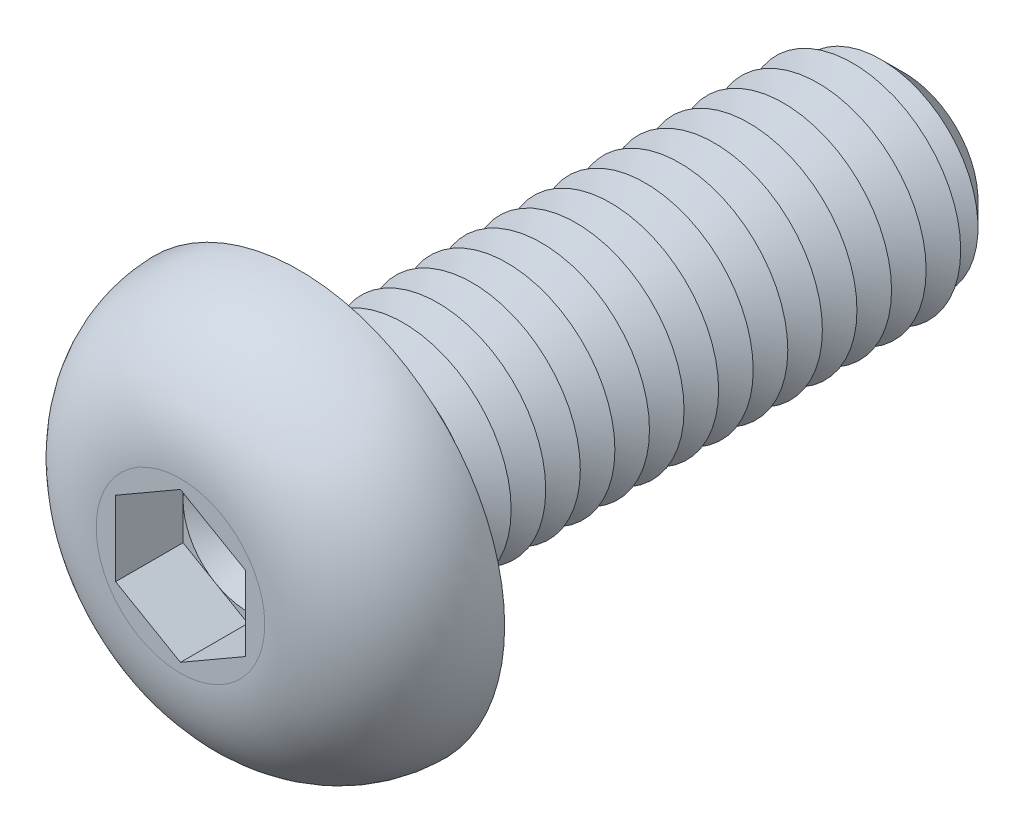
ISO-10303-21;
HEADER;
FILE_DESCRIPTION(('STEP AP214'),'2;1');
FILE_NAME('part.step','',(''),(''),'','','');
FILE_SCHEMA(('AUTOMOTIVE_DESIGN { 1 0 10303 214 1 1 1 1 }'));
ENDSEC;
DATA;
#1=APPLICATION_CONTEXT('core data for automotive mechanical design processes');
#2=APPLICATION_PROTOCOL_DEFINITION('international standard','automotive_design',2000,#1);
#3=PRODUCT_CONTEXT('',#1,'mechanical');
#4=PRODUCT('Part','Part','',(#3));
#5=PRODUCT_RELATED_PRODUCT_CATEGORY('part','',(#4));
#6=PRODUCT_DEFINITION_FORMATION('','',#4);
#7=PRODUCT_DEFINITION_CONTEXT('part definition',#1,'design');
#8=PRODUCT_DEFINITION('design','',#6,#7);
#9=PRODUCT_DEFINITION_SHAPE('','',#8);
#10=(LENGTH_UNIT() NAMED_UNIT(*) SI_UNIT(.MILLI.,.METRE.));
#11=(NAMED_UNIT(*) PLANE_ANGLE_UNIT() SI_UNIT($,.RADIAN.));
#12=(NAMED_UNIT(*) SI_UNIT($,.STERADIAN.) SOLID_ANGLE_UNIT());
#13=UNCERTAINTY_MEASURE_WITH_UNIT(LENGTH_MEASURE(1.E-05),#10,'distance_accuracy_value','');
#14=(GEOMETRIC_REPRESENTATION_CONTEXT(3) GLOBAL_UNCERTAINTY_ASSIGNED_CONTEXT((#13)) GLOBAL_UNIT_ASSIGNED_CONTEXT((#10,
#11,#12)) REPRESENTATION_CONTEXT('',''));
#15=CARTESIAN_POINT('',(0.,0.,0.));
#16=DIRECTION('',(0.,0.,1.));
#17=DIRECTION('',(1.,0.,0.));
#18=AXIS2_PLACEMENT_3D('',#15,#16,#17);
#19=CARTESIAN_POINT('',(0.,0.,1.19));
#20=DIRECTION('',(0.,0.,1.));
#21=DIRECTION('',(1.,0.,0.));
#22=AXIS2_PLACEMENT_3D('',#19,#20,#21);
#23=PLANE('',#22);
#24=CARTESIAN_POINT('',(0.,0.,1.19));
#25=DIRECTION('',(0.,0.,1.));
#26=DIRECTION('',(1.,0.,0.));
#27=AXIS2_PLACEMENT_3D('',#24,#25,#26);
#28=CIRCLE('',#27,1.5);
#29=CARTESIAN_POINT('',(1.5,0.,1.19));
#30=VERTEX_POINT('',#29);
#31=CARTESIAN_POINT('',(0.75,1.29903810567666,1.19));
#32=VERTEX_POINT('',#31);
#33=EDGE_CURVE('E117',#30,#32,#28,.T.);
#34=ORIENTED_EDGE('',*,*,#33,.F.);
#35=DIRECTION('',(0.,1.,0.));
#36=VECTOR('',#35,1.);
#37=CARTESIAN_POINT('',(1.5,-0.866025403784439,1.19));
#38=LINE('',#37,#36);
#39=CARTESIAN_POINT('',(1.5,0.86602540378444,1.19));
#40=VERTEX_POINT('',#39);
#41=EDGE_CURVE('E140',#30,#40,#38,.T.);
#42=ORIENTED_EDGE('',*,*,#41,.T.);
#43=DIRECTION('',(-0.866025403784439,0.5,0.));
#44=VECTOR('',#43,1.);
#45=CARTESIAN_POINT('',(1.5,0.86602540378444,1.19));
#46=LINE('',#45,#44);
#47=EDGE_CURVE('E135',#40,#32,#46,.T.);
#48=ORIENTED_EDGE('',*,*,#47,.T.);
#49=EDGE_LOOP('',(#34,#42,#48));
#50=FACE_BOUND('',#49,.T.);
#51=ADVANCED_FACE('F39',(#50),#23,.T.);
#52=CARTESIAN_POINT('',(0.,0.,1.19));
#53=DIRECTION('',(0.,0.,1.));
#54=DIRECTION('',(1.,0.,0.));
#55=AXIS2_PLACEMENT_3D('',#52,#53,#54);
#56=CIRCLE('',#55,1.5);
#57=CARTESIAN_POINT('',(-0.75,1.29903810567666,1.19));
#58=VERTEX_POINT('',#57);
#59=EDGE_CURVE('E11',#32,#58,#56,.T.);
#60=ORIENTED_EDGE('',*,*,#59,.F.);
#61=CARTESIAN_POINT('',(0.,1.73205080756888,1.19));
#62=VERTEX_POINT('',#61);
#63=EDGE_CURVE('E130',#32,#62,#46,.T.);
#64=ORIENTED_EDGE('',*,*,#63,.T.);
#65=DIRECTION('',(-0.866025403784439,-0.5,0.));
#66=VECTOR('',#65,1.);
#67=CARTESIAN_POINT('',(0.,1.73205080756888,1.19));
#68=LINE('',#67,#66);
#69=EDGE_CURVE('E132',#62,#58,#68,.T.);
#70=ORIENTED_EDGE('',*,*,#69,.T.);
#71=EDGE_LOOP('',(#60,#64,#70));
#72=FACE_BOUND('',#71,.T.);
#73=ADVANCED_FACE('F129',(#72),#23,.T.);
#74=CARTESIAN_POINT('',(-1.5,0.,1.19));
#75=VERTEX_POINT('',#74);
#76=EDGE_CURVE('E49',#58,#75,#56,.T.);
#77=ORIENTED_EDGE('',*,*,#76,.F.);
#78=CARTESIAN_POINT('',(-1.5,0.866025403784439,1.19));
#79=VERTEX_POINT('',#78);
#80=EDGE_CURVE('E143',#58,#79,#68,.T.);
#81=ORIENTED_EDGE('',*,*,#80,.T.);
#82=DIRECTION('',(0.,-1.,0.));
#83=VECTOR('',#82,1.);
#84=CARTESIAN_POINT('',(-1.5,0.866025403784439,1.19));
#85=LINE('',#84,#83);
#86=EDGE_CURVE('E154',#79,#75,#85,.T.);
#87=ORIENTED_EDGE('',*,*,#86,.T.);
#88=EDGE_LOOP('',(#77,#81,#87));
#89=FACE_BOUND('',#88,.T.);
#90=ADVANCED_FACE('F255',(#89),#23,.T.);
#91=CARTESIAN_POINT('',(-0.75,-1.29903810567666,1.19));
#92=VERTEX_POINT('',#91);
#93=EDGE_CURVE('E241',#75,#92,#56,.T.);
#94=ORIENTED_EDGE('',*,*,#93,.F.);
#95=CARTESIAN_POINT('',(-1.5,-0.866025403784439,1.19));
#96=VERTEX_POINT('',#95);
#97=EDGE_CURVE('E153',#75,#96,#85,.T.);
#98=ORIENTED_EDGE('',*,*,#97,.T.);
#99=DIRECTION('',(0.866025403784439,-0.5,0.));
#100=VECTOR('',#99,1.);
#101=CARTESIAN_POINT('',(-1.5,-0.866025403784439,1.19));
#102=LINE('',#101,#100);
#103=EDGE_CURVE('E159',#96,#92,#102,.T.);
#104=ORIENTED_EDGE('',*,*,#103,.T.);
#105=EDGE_LOOP('',(#94,#98,#104));
#106=FACE_BOUND('',#105,.T.);
#107=ADVANCED_FACE('F248',(#106),#23,.T.);
#108=CARTESIAN_POINT('',(0.75,-1.29903810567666,1.19));
#109=VERTEX_POINT('',#108);
#110=EDGE_CURVE('E56',#92,#109,#56,.T.);
#111=ORIENTED_EDGE('',*,*,#110,.F.);
#112=CARTESIAN_POINT('',(0.,-1.73205080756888,1.19));
#113=VERTEX_POINT('',#112);
#114=EDGE_CURVE('E158',#92,#113,#102,.T.);
#115=ORIENTED_EDGE('',*,*,#114,.T.);
#116=DIRECTION('',(0.866025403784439,0.5,0.));
#117=VECTOR('',#116,1.);
#118=CARTESIAN_POINT('',(0.,-1.73205080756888,1.19));
#119=LINE('',#118,#117);
#120=EDGE_CURVE('E164',#113,#109,#119,.T.);
#121=ORIENTED_EDGE('',*,*,#120,.T.);
#122=EDGE_LOOP('',(#111,#115,#121));
#123=FACE_BOUND('',#122,.T.);
#124=ADVANCED_FACE('F428',(#123),#23,.T.);
#125=CARTESIAN_POINT('',(0.,0.,-14.));
#126=DIRECTION('',(0.,0.,1.));
#127=DIRECTION('',(1.,0.,0.));
#128=AXIS2_PLACEMENT_3D('',#125,#126,#127);
#129=CYLINDRICAL_SURFACE('',#128,2.5);
#130=CARTESIAN_POINT('',(0.,0.,-0.399999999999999));
#131=DIRECTION('',(0.,0.,1.));
#132=DIRECTION('',(1.,0.,0.));
#133=AXIS2_PLACEMENT_3D('',#130,#131,#132);
#134=CIRCLE('',#133,2.5);
#135=CARTESIAN_POINT('',(2.5,0.,-0.399999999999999));
#136=VERTEX_POINT('',#135);
#137=EDGE_CURVE('E222',#136,#136,#134,.F.);
#138=ORIENTED_EDGE('',*,*,#137,.T.);
#139=EDGE_LOOP('',(#138));
#140=FACE_BOUND('',#139,.T.);
#141=CARTESIAN_POINT('',(0.,0.,-0.800000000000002));
#142=DIRECTION('',(0.,0.,1.));
#143=DIRECTION('',(1.,0.,0.));
#144=AXIS2_PLACEMENT_3D('',#141,#142,#143);
#145=CIRCLE('',#144,2.5);
#146=CARTESIAN_POINT('',(2.5,0.,-0.800000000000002));
#147=VERTEX_POINT('',#146);
#148=EDGE_CURVE('E149',#147,#147,#145,.T.);
#149=ORIENTED_EDGE('',*,*,#148,.T.);
#150=EDGE_LOOP('',(#149));
#151=FACE_BOUND('',#150,.T.);
#152=ADVANCED_FACE('F437',(#140,#151),#129,.T.);
#153=CARTESIAN_POINT('',(0.,4.75,0.));
#154=DIRECTION('',(0.,0.,1.));
#155=DIRECTION('',(1.,0.,0.));
#156=AXIS2_PLACEMENT_3D('',#153,#154,#155);
#157=PLANE('',#156);
#158=CARTESIAN_POINT('',(0.,0.,0.));
#159=DIRECTION('',(0.,0.,1.));
#160=DIRECTION('',(1.,0.,0.));
#161=AXIS2_PLACEMENT_3D('',#158,#159,#160);
#162=CIRCLE('',#161,2.9);
#163=CARTESIAN_POINT('',(2.9,0.,0.));
#164=VERTEX_POINT('',#163);
#165=EDGE_CURVE('E231',#164,#164,#162,.T.);
#166=ORIENTED_EDGE('',*,*,#165,.T.);
#167=EDGE_LOOP('',(#166));
#168=FACE_BOUND('',#167,.T.);
#169=CARTESIAN_POINT('',(0.,0.,0.));
#170=DIRECTION('',(0.,0.,1.));
#171=DIRECTION('',(1.,0.,0.));
#172=AXIS2_PLACEMENT_3D('',#169,#170,#171);
#173=CIRCLE('',#172,4.75);
#174=CARTESIAN_POINT('',(4.75,0.,0.));
#175=VERTEX_POINT('',#174);
#176=EDGE_CURVE('E196',#175,#175,#173,.T.);
#177=ORIENTED_EDGE('',*,*,#176,.F.);
#178=EDGE_LOOP('',(#177));
#179=FACE_BOUND('',#178,.T.);
#180=ADVANCED_FACE('F442',(#168,#179),#157,.F.);
#181=CARTESIAN_POINT('',(0.,0.,2.75));
#182=DIRECTION('',(0.,0.,-1.));
#183=DIRECTION('',(-1.,0.,0.));
#184=AXIS2_PLACEMENT_3D('',#181,#182,#183);
#185=PLANE('',#184);
#186=DIRECTION('',(-0.866025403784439,-0.5,0.));
#187=VECTOR('',#186,1.);
#188=CARTESIAN_POINT('',(0.,1.73205080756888,2.75));
#189=LINE('',#188,#187);
#190=CARTESIAN_POINT('',(0.,1.73205080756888,2.75));
#191=VERTEX_POINT('',#190);
#192=CARTESIAN_POINT('',(-1.5,0.866025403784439,2.75));
#193=VERTEX_POINT('',#192);
#194=EDGE_CURVE('E174',#191,#193,#189,.T.);
#195=ORIENTED_EDGE('',*,*,#194,.F.);
#196=DIRECTION('',(-0.866025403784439,0.5,0.));
#197=VECTOR('',#196,1.);
#198=CARTESIAN_POINT('',(1.5,0.86602540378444,2.75));
#199=LINE('',#198,#197);
#200=CARTESIAN_POINT('',(1.5,0.86602540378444,2.75));
#201=VERTEX_POINT('',#200);
#202=EDGE_CURVE('E64',#201,#191,#199,.T.);
#203=ORIENTED_EDGE('',*,*,#202,.F.);
#204=DIRECTION('',(0.,1.,0.));
#205=VECTOR('',#204,1.);
#206=CARTESIAN_POINT('',(1.5,-0.866025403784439,2.75));
#207=LINE('',#206,#205);
#208=CARTESIAN_POINT('',(1.5,-0.866025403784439,2.75));
#209=VERTEX_POINT('',#208);
#210=EDGE_CURVE('E138',#209,#201,#207,.T.);
#211=ORIENTED_EDGE('',*,*,#210,.F.);
#212=DIRECTION('',(0.866025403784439,0.5,0.));
#213=VECTOR('',#212,1.);
#214=CARTESIAN_POINT('',(0.,-1.73205080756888,2.75));
#215=LINE('',#214,#213);
#216=CARTESIAN_POINT('',(0.,-1.73205080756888,2.75));
#217=VERTEX_POINT('',#216);
#218=EDGE_CURVE('E186',#217,#209,#215,.T.);
#219=ORIENTED_EDGE('',*,*,#218,.F.);
#220=DIRECTION('',(0.866025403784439,-0.5,0.));
#221=VECTOR('',#220,1.);
#222=CARTESIAN_POINT('',(-1.5,-0.866025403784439,2.75));
#223=LINE('',#222,#221);
#224=CARTESIAN_POINT('',(-1.5,-0.866025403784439,2.75));
#225=VERTEX_POINT('',#224);
#226=EDGE_CURVE('E182',#225,#217,#223,.T.);
#227=ORIENTED_EDGE('',*,*,#226,.F.);
#228=DIRECTION('',(0.,-1.,0.));
#229=VECTOR('',#228,1.);
#230=CARTESIAN_POINT('',(-1.5,0.866025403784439,2.75));
#231=LINE('',#230,#229);
#232=EDGE_CURVE('E178',#193,#225,#231,.T.);
#233=ORIENTED_EDGE('',*,*,#232,.F.);
#234=EDGE_LOOP('',(#195,#203,#211,#219,#227,#233));
#235=FACE_BOUND('',#234,.T.);
#236=CARTESIAN_POINT('',(0.,0.,2.75));
#237=DIRECTION('',(0.,0.,1.));
#238=DIRECTION('',(1.,0.,0.));
#239=AXIS2_PLACEMENT_3D('',#236,#237,#238);
#240=CIRCLE('',#239,1.95044646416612);
#241=CARTESIAN_POINT('',(1.95044646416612,0.,2.75));
#242=VERTEX_POINT('',#241);
#243=EDGE_CURVE('E214',#242,#242,#240,.T.);
#244=ORIENTED_EDGE('',*,*,#243,.T.);
#245=EDGE_LOOP('',(#244));
#246=FACE_BOUND('',#245,.T.);
#247=ADVANCED_FACE('F264',(#235,#246),#185,.F.);
#248=CARTESIAN_POINT('',(0.,0.,-0.0500000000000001));
#249=DIRECTION('',(0.,0.,1.));
#250=DIRECTION('',(1.,0.,0.));
#251=AXIS2_PLACEMENT_3D('',#248,#249,#250);
#252=DEGENERATE_TOROIDAL_SURFACE('',#251,1.95044646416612,2.8,.T.);
#253=ORIENTED_EDGE('',*,*,#243,.F.);
#254=EDGE_LOOP('',(#253));
#255=FACE_BOUND('',#254,.T.);
#256=ORIENTED_EDGE('',*,*,#176,.T.);
#257=EDGE_LOOP('',(#256));
#258=FACE_BOUND('',#257,.T.);
#259=ADVANCED_FACE('F458',(#255,#258),#252,.T.);
#260=CARTESIAN_POINT('',(1.5,0.86602540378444,1.19));
#261=DIRECTION('',(0.5,0.866025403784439,0.));
#262=DIRECTION('',(-0.866025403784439,0.5,0.));
#263=AXIS2_PLACEMENT_3D('',#260,#261,#262);
#264=PLANE('',#263);
#265=ORIENTED_EDGE('',*,*,#202,.T.);
#266=DIRECTION('',(0.,0.,1.));
#267=VECTOR('',#266,1.);
#268=CARTESIAN_POINT('',(0.,1.73205080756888,1.19));
#269=LINE('',#268,#267);
#270=EDGE_CURVE('E136',#62,#191,#269,.T.);
#271=ORIENTED_EDGE('',*,*,#270,.F.);
#272=ORIENTED_EDGE('',*,*,#63,.F.);
#273=ORIENTED_EDGE('',*,*,#47,.F.);
#274=DIRECTION('',(0.,0.,1.));
#275=VECTOR('',#274,1.);
#276=CARTESIAN_POINT('',(1.5,0.86602540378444,1.19));
#277=LINE('',#276,#275);
#278=EDGE_CURVE('E193',#40,#201,#277,.T.);
#279=ORIENTED_EDGE('',*,*,#278,.T.);
#280=EDGE_LOOP('',(#265,#271,#272,#273,#279));
#281=FACE_BOUND('',#280,.T.);
#282=ADVANCED_FACE('F134',(#281),#264,.F.);
#283=CARTESIAN_POINT('',(1.5,-0.866025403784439,1.19));
#284=DIRECTION('',(1.,0.,0.));
#285=DIRECTION('',(0.,1.,0.));
#286=AXIS2_PLACEMENT_3D('',#283,#284,#285);
#287=PLANE('',#286);
#288=ORIENTED_EDGE('',*,*,#210,.T.);
#289=ORIENTED_EDGE('',*,*,#278,.F.);
#290=ORIENTED_EDGE('',*,*,#41,.F.);
#291=CARTESIAN_POINT('',(1.5,-0.866025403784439,1.19));
#292=VERTEX_POINT('',#291);
#293=EDGE_CURVE('E168',#292,#30,#38,.T.);
#294=ORIENTED_EDGE('',*,*,#293,.F.);
#295=DIRECTION('',(0.,0.,1.));
#296=VECTOR('',#295,1.);
#297=CARTESIAN_POINT('',(1.5,-0.866025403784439,1.19));
#298=LINE('',#297,#296);
#299=EDGE_CURVE('E197',#292,#209,#298,.T.);
#300=ORIENTED_EDGE('',*,*,#299,.T.);
#301=EDGE_LOOP('',(#288,#289,#290,#294,#300));
#302=FACE_BOUND('',#301,.T.);
#303=ADVANCED_FACE('F450',(#302),#287,.F.);
#304=CARTESIAN_POINT('',(0.,-1.73205080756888,1.19));
#305=DIRECTION('',(0.5,-0.866025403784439,0.));
#306=DIRECTION('',(0.866025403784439,0.5,0.));
#307=AXIS2_PLACEMENT_3D('',#304,#305,#306);
#308=PLANE('',#307);
#309=ORIENTED_EDGE('',*,*,#218,.T.);
#310=ORIENTED_EDGE('',*,*,#299,.F.);
#311=EDGE_CURVE('E163',#109,#292,#119,.T.);
#312=ORIENTED_EDGE('',*,*,#311,.F.);
#313=ORIENTED_EDGE('',*,*,#120,.F.);
#314=DIRECTION('',(0.,0.,1.));
#315=VECTOR('',#314,1.);
#316=CARTESIAN_POINT('',(0.,-1.73205080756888,1.19));
#317=LINE('',#316,#315);
#318=EDGE_CURVE('E200',#113,#217,#317,.T.);
#319=ORIENTED_EDGE('',*,*,#318,.T.);
#320=EDGE_LOOP('',(#309,#310,#312,#313,#319));
#321=FACE_BOUND('',#320,.T.);
#322=ADVANCED_FACE('F446',(#321),#308,.F.);
#323=CARTESIAN_POINT('',(-1.5,-0.866025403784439,1.19));
#324=DIRECTION('',(-0.5,-0.866025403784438,0.));
#325=DIRECTION('',(0.866025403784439,-0.5,0.));
#326=AXIS2_PLACEMENT_3D('',#323,#324,#325);
#327=PLANE('',#326);
#328=ORIENTED_EDGE('',*,*,#226,.T.);
#329=ORIENTED_EDGE('',*,*,#318,.F.);
#330=ORIENTED_EDGE('',*,*,#114,.F.);
#331=ORIENTED_EDGE('',*,*,#103,.F.);
#332=DIRECTION('',(0.,0.,1.));
#333=VECTOR('',#332,1.);
#334=CARTESIAN_POINT('',(-1.5,-0.866025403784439,1.19));
#335=LINE('',#334,#333);
#336=EDGE_CURVE('E203',#96,#225,#335,.T.);
#337=ORIENTED_EDGE('',*,*,#336,.T.);
#338=EDGE_LOOP('',(#328,#329,#330,#331,#337));
#339=FACE_BOUND('',#338,.T.);
#340=ADVANCED_FACE('F269',(#339),#327,.F.);
#341=CARTESIAN_POINT('',(-1.5,0.866025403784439,1.19));
#342=DIRECTION('',(-1.,0.,0.));
#343=DIRECTION('',(0.,-1.,0.));
#344=AXIS2_PLACEMENT_3D('',#341,#342,#343);
#345=PLANE('',#344);
#346=ORIENTED_EDGE('',*,*,#232,.T.);
#347=ORIENTED_EDGE('',*,*,#336,.F.);
#348=ORIENTED_EDGE('',*,*,#97,.F.);
#349=ORIENTED_EDGE('',*,*,#86,.F.);
#350=DIRECTION('',(0.,0.,1.));
#351=VECTOR('',#350,1.);
#352=CARTESIAN_POINT('',(-1.5,0.866025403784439,1.19));
#353=LINE('',#352,#351);
#354=EDGE_CURVE('E206',#79,#193,#353,.T.);
#355=ORIENTED_EDGE('',*,*,#354,.T.);
#356=EDGE_LOOP('',(#346,#347,#348,#349,#355));
#357=FACE_BOUND('',#356,.T.);
#358=ADVANCED_FACE('F253',(#357),#345,.F.);
#359=CARTESIAN_POINT('',(0.,1.73205080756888,1.19));
#360=DIRECTION('',(-0.5,0.866025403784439,0.));
#361=DIRECTION('',(-0.866025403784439,-0.5,0.));
#362=AXIS2_PLACEMENT_3D('',#359,#360,#361);
#363=PLANE('',#362);
#364=ORIENTED_EDGE('',*,*,#194,.T.);
#365=ORIENTED_EDGE('',*,*,#354,.F.);
#366=ORIENTED_EDGE('',*,*,#80,.F.);
#367=ORIENTED_EDGE('',*,*,#69,.F.);
#368=ORIENTED_EDGE('',*,*,#270,.T.);
#369=EDGE_LOOP('',(#364,#365,#366,#367,#368));
#370=FACE_BOUND('',#369,.T.);
#371=ADVANCED_FACE('F258',(#370),#363,.F.);
#372=EDGE_CURVE('E43',#109,#30,#56,.T.);
#373=ORIENTED_EDGE('',*,*,#372,.F.);
#374=ORIENTED_EDGE('',*,*,#311,.T.);
#375=ORIENTED_EDGE('',*,*,#293,.T.);
#376=EDGE_LOOP('',(#373,#374,#375));
#377=FACE_BOUND('',#376,.T.);
#378=ADVANCED_FACE('F419',(#377),#23,.T.);
#379=CARTESIAN_POINT('',(0.,0.,-0.800000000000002));
#380=DIRECTION('',(0.,0.,1.));
#381=DIRECTION('',(1.,0.,0.));
#382=AXIS2_PLACEMENT_3D('',#379,#380,#381);
#383=CONICAL_SURFACE('',#382,2.5,1.0471975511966);
#384=CARTESIAN_POINT('',(0.,0.,-1.2));
#385=DIRECTION('',(0.,0.,1.));
#386=DIRECTION('',(1.,0.,0.));
#387=AXIS2_PLACEMENT_3D('',#384,#385,#386);
#388=CIRCLE('',#387,1.80717967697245);
#389=CARTESIAN_POINT('',(1.80717967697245,0.,-1.2));
#390=VERTEX_POINT('',#389);
#391=EDGE_CURVE('E288',#390,#390,#388,.T.);
#392=ORIENTED_EDGE('',*,*,#391,.T.);
#393=EDGE_LOOP('',(#392));
#394=FACE_BOUND('',#393,.T.);
#395=ORIENTED_EDGE('',*,*,#148,.F.);
#396=EDGE_LOOP('',(#395));
#397=FACE_BOUND('',#396,.T.);
#398=ADVANCED_FACE('F426',(#394,#397),#383,.T.);
#399=CARTESIAN_POINT('',(0.,0.,-1.2));
#400=DIRECTION('',(0.,0.,-1.));
#401=DIRECTION('',(-1.,0.,0.));
#402=AXIS2_PLACEMENT_3D('',#399,#400,#401);
#403=CONICAL_SURFACE('',#402,1.80717967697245,1.04719755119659);
#404=CARTESIAN_POINT('',(0.,0.,-1.6));
#405=DIRECTION('',(0.,0.,1.));
#406=DIRECTION('',(1.,0.,0.));
#407=AXIS2_PLACEMENT_3D('',#404,#405,#406);
#408=CIRCLE('',#407,2.5);
#409=CARTESIAN_POINT('',(2.5,0.,-1.6));
#410=VERTEX_POINT('',#409);
#411=EDGE_CURVE('E293',#410,#410,#408,.T.);
#412=ORIENTED_EDGE('',*,*,#411,.T.);
#413=EDGE_LOOP('',(#412));
#414=FACE_BOUND('',#413,.T.);
#415=ORIENTED_EDGE('',*,*,#391,.F.);
#416=EDGE_LOOP('',(#415));
#417=FACE_BOUND('',#416,.T.);
#418=ADVANCED_FACE('F433',(#414,#417),#403,.T.);
#419=CARTESIAN_POINT('',(0.,0.,-1.6));
#420=DIRECTION('',(0.,0.,1.));
#421=DIRECTION('',(1.,0.,0.));
#422=AXIS2_PLACEMENT_3D('',#419,#420,#421);
#423=CONICAL_SURFACE('',#422,2.5,1.0471975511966);
#424=CARTESIAN_POINT('',(0.,0.,-2.));
#425=DIRECTION('',(0.,0.,1.));
#426=DIRECTION('',(1.,0.,0.));
#427=AXIS2_PLACEMENT_3D('',#424,#425,#426);
#428=CIRCLE('',#427,1.80717967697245);
#429=CARTESIAN_POINT('',(1.80717967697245,0.,-2.));
#430=VERTEX_POINT('',#429);
#431=EDGE_CURVE('E299',#430,#430,#428,.T.);
#432=ORIENTED_EDGE('',*,*,#431,.T.);
#433=EDGE_LOOP('',(#432));
#434=FACE_BOUND('',#433,.T.);
#435=ORIENTED_EDGE('',*,*,#411,.F.);
#436=EDGE_LOOP('',(#435));
#437=FACE_BOUND('',#436,.T.);
#438=ADVANCED_FACE('F868',(#434,#437),#423,.T.);
#439=CARTESIAN_POINT('',(0.,0.,-2.));
#440=DIRECTION('',(0.,0.,-1.));
#441=DIRECTION('',(-1.,0.,0.));
#442=AXIS2_PLACEMENT_3D('',#439,#440,#441);
#443=CONICAL_SURFACE('',#442,1.80717967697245,1.04719755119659);
#444=CARTESIAN_POINT('',(0.,0.,-2.4));
#445=DIRECTION('',(0.,0.,1.));
#446=DIRECTION('',(1.,0.,0.));
#447=AXIS2_PLACEMENT_3D('',#444,#445,#446);
#448=CIRCLE('',#447,2.5);
#449=CARTESIAN_POINT('',(2.5,0.,-2.4));
#450=VERTEX_POINT('',#449);
#451=EDGE_CURVE('E305',#450,#450,#448,.T.);
#452=ORIENTED_EDGE('',*,*,#451,.T.);
#453=EDGE_LOOP('',(#452));
#454=FACE_BOUND('',#453,.T.);
#455=ORIENTED_EDGE('',*,*,#431,.F.);
#456=EDGE_LOOP('',(#455));
#457=FACE_BOUND('',#456,.T.);
#458=ADVANCED_FACE('F858',(#454,#457),#443,.T.);
#459=CARTESIAN_POINT('',(0.,0.,-2.4));
#460=DIRECTION('',(0.,0.,1.));
#461=DIRECTION('',(1.,0.,0.));
#462=AXIS2_PLACEMENT_3D('',#459,#460,#461);
#463=CONICAL_SURFACE('',#462,2.5,1.0471975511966);
#464=CARTESIAN_POINT('',(0.,0.,-2.8));
#465=DIRECTION('',(0.,0.,1.));
#466=DIRECTION('',(1.,0.,0.));
#467=AXIS2_PLACEMENT_3D('',#464,#465,#466);
#468=CIRCLE('',#467,1.80717967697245);
#469=CARTESIAN_POINT('',(1.80717967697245,0.,-2.8));
#470=VERTEX_POINT('',#469);
#471=EDGE_CURVE('E309',#470,#470,#468,.T.);
#472=ORIENTED_EDGE('',*,*,#471,.T.);
#473=EDGE_LOOP('',(#472));
#474=FACE_BOUND('',#473,.T.);
#475=ORIENTED_EDGE('',*,*,#451,.F.);
#476=EDGE_LOOP('',(#475));
#477=FACE_BOUND('',#476,.T.);
#478=ADVANCED_FACE('F848',(#474,#477),#463,.T.);
#479=CARTESIAN_POINT('',(0.,0.,-2.8));
#480=DIRECTION('',(0.,0.,-1.));
#481=DIRECTION('',(-1.,0.,0.));
#482=AXIS2_PLACEMENT_3D('',#479,#480,#481);
#483=CONICAL_SURFACE('',#482,1.80717967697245,1.04719755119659);
#484=CARTESIAN_POINT('',(0.,0.,-3.2));
#485=DIRECTION('',(0.,0.,1.));
#486=DIRECTION('',(1.,0.,0.));
#487=AXIS2_PLACEMENT_3D('',#484,#485,#486);
#488=CIRCLE('',#487,2.5);
#489=CARTESIAN_POINT('',(2.5,0.,-3.2));
#490=VERTEX_POINT('',#489);
#491=EDGE_CURVE('E313',#490,#490,#488,.T.);
#492=ORIENTED_EDGE('',*,*,#491,.T.);
#493=EDGE_LOOP('',(#492));
#494=FACE_BOUND('',#493,.T.);
#495=ORIENTED_EDGE('',*,*,#471,.F.);
#496=EDGE_LOOP('',(#495));
#497=FACE_BOUND('',#496,.T.);
#498=ADVANCED_FACE('F838',(#494,#497),#483,.T.);
#499=CARTESIAN_POINT('',(0.,0.,-3.2));
#500=DIRECTION('',(0.,0.,1.));
#501=DIRECTION('',(1.,0.,0.));
#502=AXIS2_PLACEMENT_3D('',#499,#500,#501);
#503=CONICAL_SURFACE('',#502,2.5,1.0471975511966);
#504=CARTESIAN_POINT('',(0.,0.,-3.6));
#505=DIRECTION('',(0.,0.,1.));
#506=DIRECTION('',(1.,0.,0.));
#507=AXIS2_PLACEMENT_3D('',#504,#505,#506);
#508=CIRCLE('',#507,1.80717967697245);
#509=CARTESIAN_POINT('',(1.80717967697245,0.,-3.6));
#510=VERTEX_POINT('',#509);
#511=EDGE_CURVE('E317',#510,#510,#508,.T.);
#512=ORIENTED_EDGE('',*,*,#511,.T.);
#513=EDGE_LOOP('',(#512));
#514=FACE_BOUND('',#513,.T.);
#515=ORIENTED_EDGE('',*,*,#491,.F.);
#516=EDGE_LOOP('',(#515));
#517=FACE_BOUND('',#516,.T.);
#518=ADVANCED_FACE('F828',(#514,#517),#503,.T.);
#519=CARTESIAN_POINT('',(0.,0.,-3.6));
#520=DIRECTION('',(0.,0.,-1.));
#521=DIRECTION('',(-1.,0.,0.));
#522=AXIS2_PLACEMENT_3D('',#519,#520,#521);
#523=CONICAL_SURFACE('',#522,1.80717967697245,1.04719755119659);
#524=CARTESIAN_POINT('',(0.,0.,-4.));
#525=DIRECTION('',(0.,0.,1.));
#526=DIRECTION('',(1.,0.,0.));
#527=AXIS2_PLACEMENT_3D('',#524,#525,#526);
#528=CIRCLE('',#527,2.5);
#529=CARTESIAN_POINT('',(2.5,0.,-4.));
#530=VERTEX_POINT('',#529);
#531=EDGE_CURVE('E320',#530,#530,#528,.T.);
#532=ORIENTED_EDGE('',*,*,#531,.T.);
#533=EDGE_LOOP('',(#532));
#534=FACE_BOUND('',#533,.T.);
#535=ORIENTED_EDGE('',*,*,#511,.F.);
#536=EDGE_LOOP('',(#535));
#537=FACE_BOUND('',#536,.T.);
#538=ADVANCED_FACE('F818',(#534,#537),#523,.T.);
#539=CARTESIAN_POINT('',(0.,0.,-4.));
#540=DIRECTION('',(0.,0.,1.));
#541=DIRECTION('',(1.,0.,0.));
#542=AXIS2_PLACEMENT_3D('',#539,#540,#541);
#543=CONICAL_SURFACE('',#542,2.5,1.0471975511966);
#544=CARTESIAN_POINT('',(0.,0.,-4.4));
#545=DIRECTION('',(0.,0.,1.));
#546=DIRECTION('',(1.,0.,0.));
#547=AXIS2_PLACEMENT_3D('',#544,#545,#546);
#548=CIRCLE('',#547,1.80717967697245);
#549=CARTESIAN_POINT('',(1.80717967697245,0.,-4.4));
#550=VERTEX_POINT('',#549);
#551=EDGE_CURVE('E324',#550,#550,#548,.T.);
#552=ORIENTED_EDGE('',*,*,#551,.T.);
#553=EDGE_LOOP('',(#552));
#554=FACE_BOUND('',#553,.T.);
#555=ORIENTED_EDGE('',*,*,#531,.F.);
#556=EDGE_LOOP('',(#555));
#557=FACE_BOUND('',#556,.T.);
#558=ADVANCED_FACE('F808',(#554,#557),#543,.T.);
#559=CARTESIAN_POINT('',(0.,0.,-4.4));
#560=DIRECTION('',(0.,0.,-1.));
#561=DIRECTION('',(-1.,0.,0.));
#562=AXIS2_PLACEMENT_3D('',#559,#560,#561);
#563=CONICAL_SURFACE('',#562,1.80717967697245,1.04719755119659);
#564=CARTESIAN_POINT('',(0.,0.,-4.8));
#565=DIRECTION('',(0.,0.,1.));
#566=DIRECTION('',(1.,0.,0.));
#567=AXIS2_PLACEMENT_3D('',#564,#565,#566);
#568=CIRCLE('',#567,2.5);
#569=CARTESIAN_POINT('',(2.5,0.,-4.8));
#570=VERTEX_POINT('',#569);
#571=EDGE_CURVE('E328',#570,#570,#568,.T.);
#572=ORIENTED_EDGE('',*,*,#571,.T.);
#573=EDGE_LOOP('',(#572));
#574=FACE_BOUND('',#573,.T.);
#575=ORIENTED_EDGE('',*,*,#551,.F.);
#576=EDGE_LOOP('',(#575));
#577=FACE_BOUND('',#576,.T.);
#578=ADVANCED_FACE('F798',(#574,#577),#563,.T.);
#579=CARTESIAN_POINT('',(0.,0.,-4.8));
#580=DIRECTION('',(0.,0.,1.));
#581=DIRECTION('',(1.,0.,0.));
#582=AXIS2_PLACEMENT_3D('',#579,#580,#581);
#583=CONICAL_SURFACE('',#582,2.5,1.0471975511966);
#584=CARTESIAN_POINT('',(0.,0.,-5.2));
#585=DIRECTION('',(0.,0.,1.));
#586=DIRECTION('',(1.,0.,0.));
#587=AXIS2_PLACEMENT_3D('',#584,#585,#586);
#588=CIRCLE('',#587,1.80717967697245);
#589=CARTESIAN_POINT('',(1.80717967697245,0.,-5.2));
#590=VERTEX_POINT('',#589);
#591=EDGE_CURVE('E331',#590,#590,#588,.T.);
#592=ORIENTED_EDGE('',*,*,#591,.T.);
#593=EDGE_LOOP('',(#592));
#594=FACE_BOUND('',#593,.T.);
#595=ORIENTED_EDGE('',*,*,#571,.F.);
#596=EDGE_LOOP('',(#595));
#597=FACE_BOUND('',#596,.T.);
#598=ADVANCED_FACE('F788',(#594,#597),#583,.T.);
#599=CARTESIAN_POINT('',(0.,0.,-5.2));
#600=DIRECTION('',(0.,0.,-1.));
#601=DIRECTION('',(-1.,0.,0.));
#602=AXIS2_PLACEMENT_3D('',#599,#600,#601);
#603=CONICAL_SURFACE('',#602,1.80717967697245,1.04719755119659);
#604=CARTESIAN_POINT('',(0.,0.,-5.6));
#605=DIRECTION('',(0.,0.,1.));
#606=DIRECTION('',(1.,0.,0.));
#607=AXIS2_PLACEMENT_3D('',#604,#605,#606);
#608=CIRCLE('',#607,2.5);
#609=CARTESIAN_POINT('',(2.5,0.,-5.6));
#610=VERTEX_POINT('',#609);
#611=EDGE_CURVE('E335',#610,#610,#608,.T.);
#612=ORIENTED_EDGE('',*,*,#611,.T.);
#613=EDGE_LOOP('',(#612));
#614=FACE_BOUND('',#613,.T.);
#615=ORIENTED_EDGE('',*,*,#591,.F.);
#616=EDGE_LOOP('',(#615));
#617=FACE_BOUND('',#616,.T.);
#618=ADVANCED_FACE('F778',(#614,#617),#603,.T.);
#619=CARTESIAN_POINT('',(0.,0.,-5.6));
#620=DIRECTION('',(0.,0.,1.));
#621=DIRECTION('',(1.,0.,0.));
#622=AXIS2_PLACEMENT_3D('',#619,#620,#621);
#623=CONICAL_SURFACE('',#622,2.5,1.0471975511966);
#624=CARTESIAN_POINT('',(0.,0.,-6.));
#625=DIRECTION('',(0.,0.,1.));
#626=DIRECTION('',(1.,0.,0.));
#627=AXIS2_PLACEMENT_3D('',#624,#625,#626);
#628=CIRCLE('',#627,1.80717967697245);
#629=CARTESIAN_POINT('',(1.80717967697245,0.,-6.));
#630=VERTEX_POINT('',#629);
#631=EDGE_CURVE('E339',#630,#630,#628,.T.);
#632=ORIENTED_EDGE('',*,*,#631,.T.);
#633=EDGE_LOOP('',(#632));
#634=FACE_BOUND('',#633,.T.);
#635=ORIENTED_EDGE('',*,*,#611,.F.);
#636=EDGE_LOOP('',(#635));
#637=FACE_BOUND('',#636,.T.);
#638=ADVANCED_FACE('F768',(#634,#637),#623,.T.);
#639=CARTESIAN_POINT('',(0.,0.,-6.));
#640=DIRECTION('',(0.,0.,-1.));
#641=DIRECTION('',(-1.,0.,0.));
#642=AXIS2_PLACEMENT_3D('',#639,#640,#641);
#643=CONICAL_SURFACE('',#642,1.80717967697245,1.04719755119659);
#644=CARTESIAN_POINT('',(0.,0.,-6.4));
#645=DIRECTION('',(0.,0.,1.));
#646=DIRECTION('',(1.,0.,0.));
#647=AXIS2_PLACEMENT_3D('',#644,#645,#646);
#648=CIRCLE('',#647,2.5);
#649=CARTESIAN_POINT('',(2.5,0.,-6.4));
#650=VERTEX_POINT('',#649);
#651=EDGE_CURVE('E342',#650,#650,#648,.T.);
#652=ORIENTED_EDGE('',*,*,#651,.T.);
#653=EDGE_LOOP('',(#652));
#654=FACE_BOUND('',#653,.T.);
#655=ORIENTED_EDGE('',*,*,#631,.F.);
#656=EDGE_LOOP('',(#655));
#657=FACE_BOUND('',#656,.T.);
#658=ADVANCED_FACE('F758',(#654,#657),#643,.T.);
#659=CARTESIAN_POINT('',(0.,0.,-6.4));
#660=DIRECTION('',(0.,0.,1.));
#661=DIRECTION('',(1.,0.,0.));
#662=AXIS2_PLACEMENT_3D('',#659,#660,#661);
#663=CONICAL_SURFACE('',#662,2.5,1.0471975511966);
#664=CARTESIAN_POINT('',(0.,0.,-6.8));
#665=DIRECTION('',(0.,0.,1.));
#666=DIRECTION('',(1.,0.,0.));
#667=AXIS2_PLACEMENT_3D('',#664,#665,#666);
#668=CIRCLE('',#667,1.80717967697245);
#669=CARTESIAN_POINT('',(1.80717967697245,0.,-6.8));
#670=VERTEX_POINT('',#669);
#671=EDGE_CURVE('E346',#670,#670,#668,.T.);
#672=ORIENTED_EDGE('',*,*,#671,.T.);
#673=EDGE_LOOP('',(#672));
#674=FACE_BOUND('',#673,.T.);
#675=ORIENTED_EDGE('',*,*,#651,.F.);
#676=EDGE_LOOP('',(#675));
#677=FACE_BOUND('',#676,.T.);
#678=ADVANCED_FACE('F748',(#674,#677),#663,.T.);
#679=CARTESIAN_POINT('',(0.,0.,-6.8));
#680=DIRECTION('',(0.,0.,-1.));
#681=DIRECTION('',(-1.,0.,0.));
#682=AXIS2_PLACEMENT_3D('',#679,#680,#681);
#683=CONICAL_SURFACE('',#682,1.80717967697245,1.04719755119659);
#684=CARTESIAN_POINT('',(0.,0.,-7.2));
#685=DIRECTION('',(0.,0.,1.));
#686=DIRECTION('',(1.,0.,0.));
#687=AXIS2_PLACEMENT_3D('',#684,#685,#686);
#688=CIRCLE('',#687,2.5);
#689=CARTESIAN_POINT('',(2.5,0.,-7.2));
#690=VERTEX_POINT('',#689);
#691=EDGE_CURVE('E349',#690,#690,#688,.T.);
#692=ORIENTED_EDGE('',*,*,#691,.T.);
#693=EDGE_LOOP('',(#692));
#694=FACE_BOUND('',#693,.T.);
#695=ORIENTED_EDGE('',*,*,#671,.F.);
#696=EDGE_LOOP('',(#695));
#697=FACE_BOUND('',#696,.T.);
#698=ADVANCED_FACE('F738',(#694,#697),#683,.T.);
#699=CARTESIAN_POINT('',(0.,0.,-7.2));
#700=DIRECTION('',(0.,0.,1.));
#701=DIRECTION('',(1.,0.,0.));
#702=AXIS2_PLACEMENT_3D('',#699,#700,#701);
#703=CONICAL_SURFACE('',#702,2.5,1.0471975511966);
#704=CARTESIAN_POINT('',(0.,0.,-7.6));
#705=DIRECTION('',(0.,0.,1.));
#706=DIRECTION('',(1.,0.,0.));
#707=AXIS2_PLACEMENT_3D('',#704,#705,#706);
#708=CIRCLE('',#707,1.80717967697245);
#709=CARTESIAN_POINT('',(1.80717967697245,0.,-7.6));
#710=VERTEX_POINT('',#709);
#711=EDGE_CURVE('E353',#710,#710,#708,.T.);
#712=ORIENTED_EDGE('',*,*,#711,.T.);
#713=EDGE_LOOP('',(#712));
#714=FACE_BOUND('',#713,.T.);
#715=ORIENTED_EDGE('',*,*,#691,.F.);
#716=EDGE_LOOP('',(#715));
#717=FACE_BOUND('',#716,.T.);
#718=ADVANCED_FACE('F728',(#714,#717),#703,.T.);
#719=CARTESIAN_POINT('',(0.,0.,-7.6));
#720=DIRECTION('',(0.,0.,-1.));
#721=DIRECTION('',(-1.,0.,0.));
#722=AXIS2_PLACEMENT_3D('',#719,#720,#721);
#723=CONICAL_SURFACE('',#722,1.80717967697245,1.04719755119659);
#724=CARTESIAN_POINT('',(0.,0.,-8.));
#725=DIRECTION('',(0.,0.,1.));
#726=DIRECTION('',(1.,0.,0.));
#727=AXIS2_PLACEMENT_3D('',#724,#725,#726);
#728=CIRCLE('',#727,2.5);
#729=CARTESIAN_POINT('',(2.5,0.,-8.));
#730=VERTEX_POINT('',#729);
#731=EDGE_CURVE('E357',#730,#730,#728,.T.);
#732=ORIENTED_EDGE('',*,*,#731,.T.);
#733=EDGE_LOOP('',(#732));
#734=FACE_BOUND('',#733,.T.);
#735=ORIENTED_EDGE('',*,*,#711,.F.);
#736=EDGE_LOOP('',(#735));
#737=FACE_BOUND('',#736,.T.);
#738=ADVANCED_FACE('F718',(#734,#737),#723,.T.);
#739=CARTESIAN_POINT('',(0.,0.,-8.));
#740=DIRECTION('',(0.,0.,1.));
#741=DIRECTION('',(1.,0.,0.));
#742=AXIS2_PLACEMENT_3D('',#739,#740,#741);
#743=CONICAL_SURFACE('',#742,2.5,1.0471975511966);
#744=CARTESIAN_POINT('',(0.,0.,-8.4));
#745=DIRECTION('',(0.,0.,1.));
#746=DIRECTION('',(1.,0.,0.));
#747=AXIS2_PLACEMENT_3D('',#744,#745,#746);
#748=CIRCLE('',#747,1.80717967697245);
#749=CARTESIAN_POINT('',(1.80717967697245,0.,-8.4));
#750=VERTEX_POINT('',#749);
#751=EDGE_CURVE('E361',#750,#750,#748,.T.);
#752=ORIENTED_EDGE('',*,*,#751,.T.);
#753=EDGE_LOOP('',(#752));
#754=FACE_BOUND('',#753,.T.);
#755=ORIENTED_EDGE('',*,*,#731,.F.);
#756=EDGE_LOOP('',(#755));
#757=FACE_BOUND('',#756,.T.);
#758=ADVANCED_FACE('F708',(#754,#757),#743,.T.);
#759=CARTESIAN_POINT('',(0.,0.,-8.4));
#760=DIRECTION('',(0.,0.,-1.));
#761=DIRECTION('',(-1.,0.,0.));
#762=AXIS2_PLACEMENT_3D('',#759,#760,#761);
#763=CONICAL_SURFACE('',#762,1.80717967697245,1.04719755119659);
#764=CARTESIAN_POINT('',(0.,0.,-8.8));
#765=DIRECTION('',(0.,0.,1.));
#766=DIRECTION('',(1.,0.,0.));
#767=AXIS2_PLACEMENT_3D('',#764,#765,#766);
#768=CIRCLE('',#767,2.5);
#769=CARTESIAN_POINT('',(2.5,0.,-8.8));
#770=VERTEX_POINT('',#769);
#771=EDGE_CURVE('E365',#770,#770,#768,.T.);
#772=ORIENTED_EDGE('',*,*,#771,.T.);
#773=EDGE_LOOP('',(#772));
#774=FACE_BOUND('',#773,.T.);
#775=ORIENTED_EDGE('',*,*,#751,.F.);
#776=EDGE_LOOP('',(#775));
#777=FACE_BOUND('',#776,.T.);
#778=ADVANCED_FACE('F698',(#774,#777),#763,.T.);
#779=CARTESIAN_POINT('',(0.,0.,-8.8));
#780=DIRECTION('',(0.,0.,1.));
#781=DIRECTION('',(1.,0.,0.));
#782=AXIS2_PLACEMENT_3D('',#779,#780,#781);
#783=CONICAL_SURFACE('',#782,2.5,1.0471975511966);
#784=CARTESIAN_POINT('',(0.,0.,-9.2));
#785=DIRECTION('',(0.,0.,1.));
#786=DIRECTION('',(1.,0.,0.));
#787=AXIS2_PLACEMENT_3D('',#784,#785,#786);
#788=CIRCLE('',#787,1.80717967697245);
#789=CARTESIAN_POINT('',(1.80717967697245,0.,-9.2));
#790=VERTEX_POINT('',#789);
#791=EDGE_CURVE('E369',#790,#790,#788,.T.);
#792=ORIENTED_EDGE('',*,*,#791,.T.);
#793=EDGE_LOOP('',(#792));
#794=FACE_BOUND('',#793,.T.);
#795=ORIENTED_EDGE('',*,*,#771,.F.);
#796=EDGE_LOOP('',(#795));
#797=FACE_BOUND('',#796,.T.);
#798=ADVANCED_FACE('F688',(#794,#797),#783,.T.);
#799=CARTESIAN_POINT('',(0.,0.,-9.2));
#800=DIRECTION('',(0.,0.,-1.));
#801=DIRECTION('',(-1.,0.,0.));
#802=AXIS2_PLACEMENT_3D('',#799,#800,#801);
#803=CONICAL_SURFACE('',#802,1.80717967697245,1.04719755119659);
#804=CARTESIAN_POINT('',(0.,0.,-9.6));
#805=DIRECTION('',(0.,0.,1.));
#806=DIRECTION('',(1.,0.,0.));
#807=AXIS2_PLACEMENT_3D('',#804,#805,#806);
#808=CIRCLE('',#807,2.5);
#809=CARTESIAN_POINT('',(2.5,0.,-9.6));
#810=VERTEX_POINT('',#809);
#811=EDGE_CURVE('E284',#810,#810,#808,.T.);
#812=ORIENTED_EDGE('',*,*,#811,.T.);
#813=EDGE_LOOP('',(#812));
#814=FACE_BOUND('',#813,.T.);
#815=ORIENTED_EDGE('',*,*,#791,.F.);
#816=EDGE_LOOP('',(#815));
#817=FACE_BOUND('',#816,.T.);
#818=ADVANCED_FACE('F678',(#814,#817),#803,.T.);
#819=CARTESIAN_POINT('',(0.,0.,-9.6));
#820=DIRECTION('',(0.,0.,1.));
#821=DIRECTION('',(1.,0.,0.));
#822=AXIS2_PLACEMENT_3D('',#819,#820,#821);
#823=CONICAL_SURFACE('',#822,2.5,1.0471975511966);
#824=CARTESIAN_POINT('',(0.,0.,-10.));
#825=DIRECTION('',(0.,0.,1.));
#826=DIRECTION('',(1.,0.,0.));
#827=AXIS2_PLACEMENT_3D('',#824,#825,#826);
#828=CIRCLE('',#827,1.80717967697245);
#829=CARTESIAN_POINT('',(1.80717967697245,0.,-10.));
#830=VERTEX_POINT('',#829);
#831=EDGE_CURVE('E282',#830,#830,#828,.T.);
#832=ORIENTED_EDGE('',*,*,#831,.T.);
#833=EDGE_LOOP('',(#832));
#834=FACE_BOUND('',#833,.T.);
#835=ORIENTED_EDGE('',*,*,#811,.F.);
#836=EDGE_LOOP('',(#835));
#837=FACE_BOUND('',#836,.T.);
#838=ADVANCED_FACE('F668',(#834,#837),#823,.T.);
#839=CARTESIAN_POINT('',(0.,0.,-10.));
#840=DIRECTION('',(0.,0.,-1.));
#841=DIRECTION('',(-1.,0.,0.));
#842=AXIS2_PLACEMENT_3D('',#839,#840,#841);
#843=CONICAL_SURFACE('',#842,1.80717967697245,1.04719755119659);
#844=CARTESIAN_POINT('',(0.,0.,-10.4));
#845=DIRECTION('',(0.,0.,1.));
#846=DIRECTION('',(1.,0.,0.));
#847=AXIS2_PLACEMENT_3D('',#844,#845,#846);
#848=CIRCLE('',#847,2.5);
#849=CARTESIAN_POINT('',(2.5,0.,-10.4));
#850=VERTEX_POINT('',#849);
#851=EDGE_CURVE('E279',#850,#850,#848,.T.);
#852=ORIENTED_EDGE('',*,*,#851,.T.);
#853=EDGE_LOOP('',(#852));
#854=FACE_BOUND('',#853,.T.);
#855=ORIENTED_EDGE('',*,*,#831,.F.);
#856=EDGE_LOOP('',(#855));
#857=FACE_BOUND('',#856,.T.);
#858=ADVANCED_FACE('F658',(#854,#857),#843,.T.);
#859=CARTESIAN_POINT('',(0.,0.,-10.4));
#860=DIRECTION('',(0.,0.,1.));
#861=DIRECTION('',(1.,0.,0.));
#862=AXIS2_PLACEMENT_3D('',#859,#860,#861);
#863=CONICAL_SURFACE('',#862,2.5,1.0471975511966);
#864=CARTESIAN_POINT('',(0.,0.,-10.8));
#865=DIRECTION('',(0.,0.,1.));
#866=DIRECTION('',(1.,0.,0.));
#867=AXIS2_PLACEMENT_3D('',#864,#865,#866);
#868=CIRCLE('',#867,1.80717967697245);
#869=CARTESIAN_POINT('',(1.80717967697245,0.,-10.8));
#870=VERTEX_POINT('',#869);
#871=EDGE_CURVE('E276',#870,#870,#868,.T.);
#872=ORIENTED_EDGE('',*,*,#871,.T.);
#873=EDGE_LOOP('',(#872));
#874=FACE_BOUND('',#873,.T.);
#875=ORIENTED_EDGE('',*,*,#851,.F.);
#876=EDGE_LOOP('',(#875));
#877=FACE_BOUND('',#876,.T.);
#878=ADVANCED_FACE('F648',(#874,#877),#863,.T.);
#879=CARTESIAN_POINT('',(0.,0.,-10.8));
#880=DIRECTION('',(0.,0.,-1.));
#881=DIRECTION('',(-1.,0.,0.));
#882=AXIS2_PLACEMENT_3D('',#879,#880,#881);
#883=CONICAL_SURFACE('',#882,1.80717967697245,1.04719755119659);
#884=CARTESIAN_POINT('',(0.,0.,-11.2));
#885=DIRECTION('',(0.,0.,1.));
#886=DIRECTION('',(1.,0.,0.));
#887=AXIS2_PLACEMENT_3D('',#884,#885,#886);
#888=CIRCLE('',#887,2.5);
#889=CARTESIAN_POINT('',(2.5,0.,-11.2));
#890=VERTEX_POINT('',#889);
#891=EDGE_CURVE('E280',#890,#890,#888,.T.);
#892=ORIENTED_EDGE('',*,*,#891,.T.);
#893=EDGE_LOOP('',(#892));
#894=FACE_BOUND('',#893,.T.);
#895=ORIENTED_EDGE('',*,*,#871,.F.);
#896=EDGE_LOOP('',(#895));
#897=FACE_BOUND('',#896,.T.);
#898=ADVANCED_FACE('F638',(#894,#897),#883,.T.);
#899=CARTESIAN_POINT('',(0.,0.,-11.2));
#900=DIRECTION('',(0.,0.,1.));
#901=DIRECTION('',(1.,0.,0.));
#902=AXIS2_PLACEMENT_3D('',#899,#900,#901);
#903=CONICAL_SURFACE('',#902,2.5,1.0471975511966);
#904=CARTESIAN_POINT('',(0.,0.,-11.6));
#905=DIRECTION('',(0.,0.,1.));
#906=DIRECTION('',(1.,0.,0.));
#907=AXIS2_PLACEMENT_3D('',#904,#905,#906);
#908=CIRCLE('',#907,1.80717967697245);
#909=CARTESIAN_POINT('',(1.80717967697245,0.,-11.6));
#910=VERTEX_POINT('',#909);
#911=EDGE_CURVE('E382',#910,#910,#908,.T.);
#912=ORIENTED_EDGE('',*,*,#911,.T.);
#913=EDGE_LOOP('',(#912));
#914=FACE_BOUND('',#913,.T.);
#915=ORIENTED_EDGE('',*,*,#891,.F.);
#916=EDGE_LOOP('',(#915));
#917=FACE_BOUND('',#916,.T.);
#918=ADVANCED_FACE('F628',(#914,#917),#903,.T.);
#919=CARTESIAN_POINT('',(0.,0.,-11.6));
#920=DIRECTION('',(0.,0.,-1.));
#921=DIRECTION('',(-1.,0.,0.));
#922=AXIS2_PLACEMENT_3D('',#919,#920,#921);
#923=CONICAL_SURFACE('',#922,1.80717967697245,1.04719755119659);
#924=CARTESIAN_POINT('',(0.,0.,-12.));
#925=DIRECTION('',(0.,0.,1.));
#926=DIRECTION('',(1.,0.,0.));
#927=AXIS2_PLACEMENT_3D('',#924,#925,#926);
#928=CIRCLE('',#927,2.5);
#929=CARTESIAN_POINT('',(2.5,0.,-12.));
#930=VERTEX_POINT('',#929);
#931=EDGE_CURVE('E386',#930,#930,#928,.T.);
#932=ORIENTED_EDGE('',*,*,#931,.T.);
#933=EDGE_LOOP('',(#932));
#934=FACE_BOUND('',#933,.T.);
#935=ORIENTED_EDGE('',*,*,#911,.F.);
#936=EDGE_LOOP('',(#935));
#937=FACE_BOUND('',#936,.T.);
#938=ADVANCED_FACE('F618',(#934,#937),#923,.T.);
#939=CARTESIAN_POINT('',(0.,0.,-12.));
#940=DIRECTION('',(0.,0.,1.));
#941=DIRECTION('',(1.,0.,0.));
#942=AXIS2_PLACEMENT_3D('',#939,#940,#941);
#943=CONICAL_SURFACE('',#942,2.5,1.0471975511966);
#944=CARTESIAN_POINT('',(0.,0.,-12.4));
#945=DIRECTION('',(0.,0.,1.));
#946=DIRECTION('',(1.,0.,0.));
#947=AXIS2_PLACEMENT_3D('',#944,#945,#946);
#948=CIRCLE('',#947,1.80717967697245);
#949=CARTESIAN_POINT('',(1.80717967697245,0.,-12.4));
#950=VERTEX_POINT('',#949);
#951=EDGE_CURVE('E227',#950,#950,#948,.T.);
#952=ORIENTED_EDGE('',*,*,#951,.T.);
#953=EDGE_LOOP('',(#952));
#954=FACE_BOUND('',#953,.T.);
#955=ORIENTED_EDGE('',*,*,#931,.F.);
#956=EDGE_LOOP('',(#955));
#957=FACE_BOUND('',#956,.T.);
#958=ADVANCED_FACE('F608',(#954,#957),#943,.T.);
#959=CARTESIAN_POINT('',(0.,0.,-12.4));
#960=DIRECTION('',(0.,0.,-1.));
#961=DIRECTION('',(-1.,0.,0.));
#962=AXIS2_PLACEMENT_3D('',#959,#960,#961);
#963=CONICAL_SURFACE('',#962,1.80717967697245,1.04719755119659);
#964=CARTESIAN_POINT('',(0.,0.,-12.8));
#965=DIRECTION('',(0.,0.,1.));
#966=DIRECTION('',(1.,0.,0.));
#967=AXIS2_PLACEMENT_3D('',#964,#965,#966);
#968=CIRCLE('',#967,2.5);
#969=CARTESIAN_POINT('',(2.5,0.,-12.8));
#970=VERTEX_POINT('',#969);
#971=EDGE_CURVE('E228',#970,#970,#968,.T.);
#972=ORIENTED_EDGE('',*,*,#971,.T.);
#973=EDGE_LOOP('',(#972));
#974=FACE_BOUND('',#973,.T.);
#975=ORIENTED_EDGE('',*,*,#951,.F.);
#976=EDGE_LOOP('',(#975));
#977=FACE_BOUND('',#976,.T.);
#978=ADVANCED_FACE('F414',(#974,#977),#963,.T.);
#979=CARTESIAN_POINT('',(0.,0.,-12.8));
#980=DIRECTION('',(0.,0.,1.));
#981=DIRECTION('',(1.,0.,0.));
#982=AXIS2_PLACEMENT_3D('',#979,#980,#981);
#983=CONICAL_SURFACE('',#982,2.5,1.0471975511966);
#984=CARTESIAN_POINT('',(0.,0.,-13.2));
#985=DIRECTION('',(0.,0.,1.));
#986=DIRECTION('',(1.,0.,0.));
#987=AXIS2_PLACEMENT_3D('',#984,#985,#986);
#988=CIRCLE('',#987,1.80717967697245);
#989=CARTESIAN_POINT('',(1.80717967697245,0.,-13.2));
#990=VERTEX_POINT('',#989);
#991=EDGE_CURVE('E124',#990,#990,#988,.T.);
#992=ORIENTED_EDGE('',*,*,#991,.T.);
#993=EDGE_LOOP('',(#992));
#994=FACE_BOUND('',#993,.T.);
#995=ORIENTED_EDGE('',*,*,#971,.F.);
#996=EDGE_LOOP('',(#995));
#997=FACE_BOUND('',#996,.T.);
#998=ADVANCED_FACE('F399',(#994,#997),#983,.T.);
#999=CARTESIAN_POINT('',(0.,0.,-13.2));
#1000=DIRECTION('',(0.,0.,-1.));
#1001=DIRECTION('',(-1.,0.,0.));
#1002=AXIS2_PLACEMENT_3D('',#999,#1000,#1001);
#1003=CONICAL_SURFACE('',#1002,1.80717967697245,1.04719755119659);
#1004=CARTESIAN_POINT('',(0.,0.,-13.4535898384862));
#1005=DIRECTION('',(0.,0.,-1.));
#1006=DIRECTION('',(-1.,0.,0.));
#1007=AXIS2_PLACEMENT_3D('',#1004,#1005,#1006);
#1008=CIRCLE('',#1007,2.24641016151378);
#1009=CARTESIAN_POINT('',(-2.24641016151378,0.,-13.4535898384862));
#1010=VERTEX_POINT('',#1009);
#1011=EDGE_CURVE('E223',#1010,#1010,#1008,.T.);
#1012=ORIENTED_EDGE('',*,*,#1011,.F.);
#1013=EDGE_LOOP('',(#1012));
#1014=FACE_BOUND('',#1013,.T.);
#1015=ORIENTED_EDGE('',*,*,#991,.F.);
#1016=EDGE_LOOP('',(#1015));
#1017=FACE_BOUND('',#1016,.T.);
#1018=ADVANCED_FACE('F402',(#1014,#1017),#1003,.T.);
#1019=CARTESIAN_POINT('',(0.,0.,-14.));
#1020=DIRECTION('',(0.,0.,-1.));
#1021=DIRECTION('',(-1.,0.,0.));
#1022=AXIS2_PLACEMENT_3D('',#1019,#1020,#1021);
#1023=PLANE('',#1022);
#1024=CARTESIAN_POINT('',(0.,0.,-14.));
#1025=DIRECTION('',(0.,0.,-1.));
#1026=DIRECTION('',(-1.,0.,0.));
#1027=AXIS2_PLACEMENT_3D('',#1024,#1025,#1026);
#1028=CIRCLE('',#1027,1.7);
#1029=CARTESIAN_POINT('',(-1.7,0.,-14.));
#1030=VERTEX_POINT('',#1029);
#1031=EDGE_CURVE('E218',#1030,#1030,#1028,.T.);
#1032=ORIENTED_EDGE('',*,*,#1031,.T.);
#1033=EDGE_LOOP('',(#1032));
#1034=FACE_BOUND('',#1033,.T.);
#1035=ADVANCED_FACE('F404',(#1034),#1023,.T.);
#1036=CARTESIAN_POINT('',(0.,0.,-14.));
#1037=DIRECTION('',(0.,0.,1.));
#1038=DIRECTION('',(1.,0.,0.));
#1039=AXIS2_PLACEMENT_3D('',#1036,#1037,#1038);
#1040=CONICAL_SURFACE('',#1039,1.7,0.785398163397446);
#1041=ORIENTED_EDGE('',*,*,#1031,.F.);
#1042=EDGE_LOOP('',(#1041));
#1043=FACE_BOUND('',#1042,.T.);
#1044=ORIENTED_EDGE('',*,*,#1011,.T.);
#1045=EDGE_LOOP('',(#1044));
#1046=FACE_BOUND('',#1045,.T.);
#1047=ADVANCED_FACE('F411',(#1043,#1046),#1040,.T.);
#1048=CARTESIAN_POINT('',(0.,0.,-0.399999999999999));
#1049=DIRECTION('',(0.,0.,1.));
#1050=DIRECTION('',(1.,0.,0.));
#1051=AXIS2_PLACEMENT_3D('',#1048,#1049,#1050);
#1052=TOROIDAL_SURFACE('',#1051,2.9,0.4);
#1053=ORIENTED_EDGE('',*,*,#165,.F.);
#1054=EDGE_LOOP('',(#1053));
#1055=FACE_BOUND('',#1054,.T.);
#1056=ORIENTED_EDGE('',*,*,#137,.F.);
#1057=EDGE_LOOP('',(#1056));
#1058=FACE_BOUND('',#1057,.T.);
#1059=ADVANCED_FACE('F41',(#1055,#1058),#1052,.F.);
#1060=CARTESIAN_POINT('',(0.,0.,1.19));
#1061=DIRECTION('',(0.,0.,1.));
#1062=DIRECTION('',(1.,0.,0.));
#1063=AXIS2_PLACEMENT_3D('',#1060,#1061,#1062);
#1064=CONICAL_SURFACE('',#1063,1.5,1.0471975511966);
#1065=CARTESIAN_POINT('',(0.,0.,0.323974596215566));
#1066=VERTEX_POINT('',#1065);
#1067=VERTEX_LOOP('',#1066);
#1068=FACE_BOUND('',#1067,.T.);
#1069=ORIENTED_EDGE('',*,*,#33,.T.);
#1070=ORIENTED_EDGE('',*,*,#59,.T.);
#1071=ORIENTED_EDGE('',*,*,#76,.T.);
#1072=ORIENTED_EDGE('',*,*,#93,.T.);
#1073=ORIENTED_EDGE('',*,*,#110,.T.);
#1074=ORIENTED_EDGE('',*,*,#372,.T.);
#1075=EDGE_LOOP('',(#1069,#1070,#1071,#1072,#1073,#1074));
#1076=FACE_BOUND('',#1075,.T.);
#1077=ADVANCED_FACE('F113',(#1068,#1076),#1064,.F.);
#1078=CLOSED_SHELL('',(#51,#73,#90,#107,#124,#152,#180,#247,#259,#282,#303,#322,#340,#358,#371,
#378,#398,#418,#438,#458,#478,#498,#518,#538,#558,#578,#598,#618,#638,#658,#678,#698,#718,#738,
#758,#778,#798,#818,#838,#858,#878,#898,#918,#938,#958,#978,#998,#1018,#1035,#1047,#1059,#1077));
#1079=MANIFOLD_SOLID_BREP('B2',#1078);
#1080=ADVANCED_BREP_SHAPE_REPRESENTATION('',(#18,#1079),#14);
#1081=SHAPE_DEFINITION_REPRESENTATION(#9,#1080);
ENDSEC;
END-ISO-10303-21;
